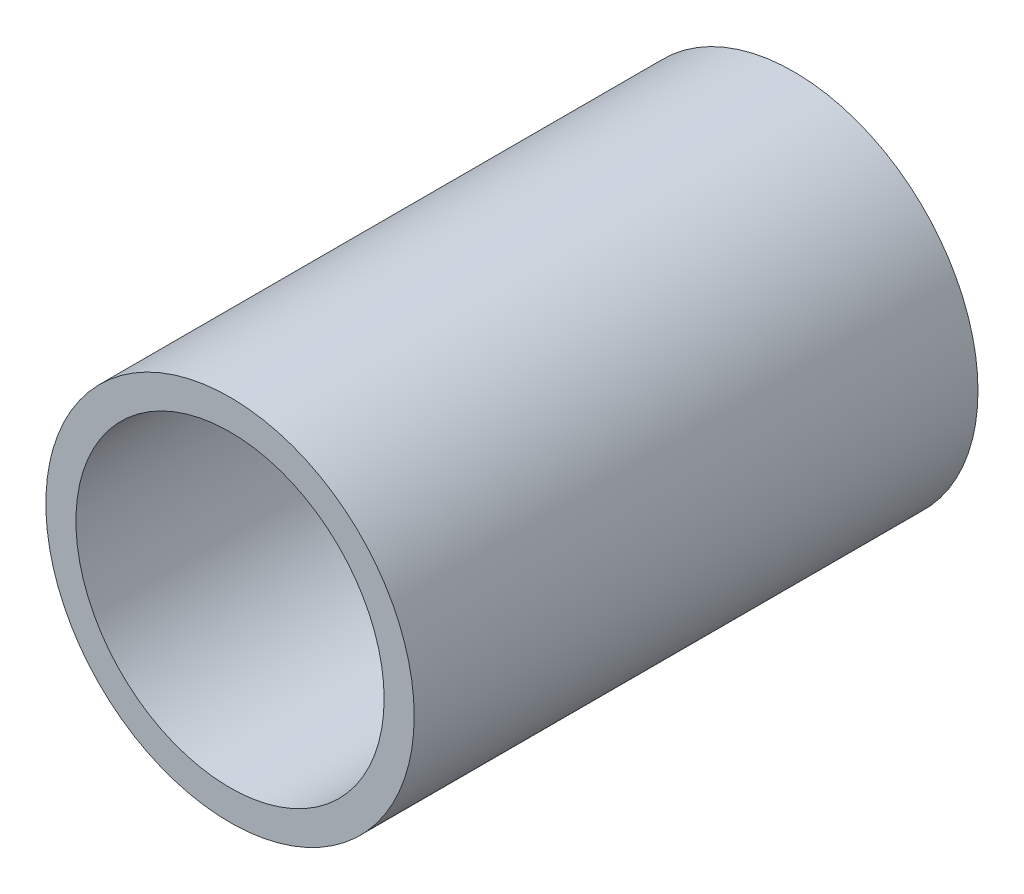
from build123d import *

# Parameters (mm, degrees)
ESQUISSE1_R      = 4.9
ESQUISSE1_R_2    = 4.1
EXTRUSION1_DEPTH = 15


with BuildPart() as part:
    # Esquisse1 → Extrusion1 (new body)
    with BuildSketch(Plane.XY):
        Circle(ESQUISSE1_R)
        Circle(ESQUISSE1_R_2, mode=Mode.SUBTRACT)
    extrude(amount=EXTRUSION1_DEPTH)


solid = part.part
